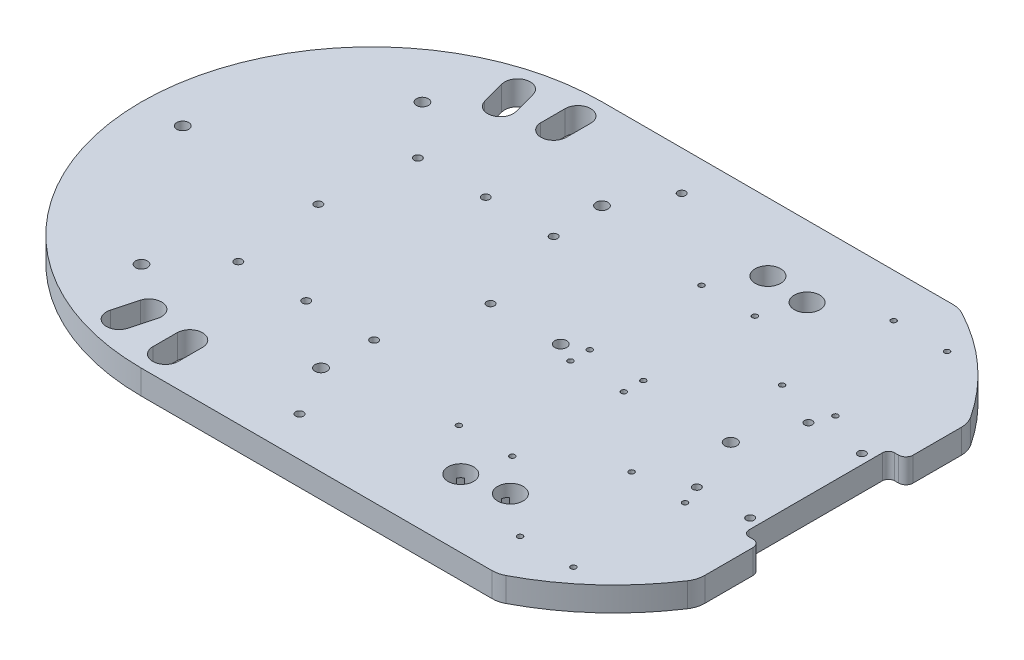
from build123d import *

# Parameters (mm, degrees)
ESQUISSE1_R             = 2.45
ESQUISSE1_R_2           = 5.25
ESQUISSE1_R_3           = 1.1
ESQUISSE1_R_4           = 1.6
ESQUISSE1_R_5           = 2.5
EXTRUSION1_DEPTH        = 10
ESQUISSE2_R             = 1.1
ENL_V_MAT_EXTRU_1_DEPTH = 5


with BuildPart() as part:
    # Esquisse1 → Extrusion1 (new body)
    with BuildSketch(Plane(origin=(0, 0, 0), x_dir=(1, 0, 0), z_dir=(0, 1, 0))):
        with BuildLine():
            Line((140.138781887, 52.856178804), (140.138781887, 32.999324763))
            ThreePointArc((140.138781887, 32.999324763), (139.26010223, 30.87800442), (137.138781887, 29.999324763))
            Line((137.138781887, 29.999324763), (135.5, 30))
            ThreePointArc((135.5, 30), (133.732233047, 29.267766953), (133, 27.5))
            Line((133, 27.5), (133, -27.5))
            ThreePointArc((133, -27.5), (133.732035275, -29.267289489), (135.499324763, -29.999324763))
            Line((135.499324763, -29.999324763), (137.138781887, -29.999324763))
            ThreePointArc((137.138781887, -29.999324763), (139.26010223, -30.87800442), (140.138781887, -32.999324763))
            Line((140.138781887, -32.999324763), (140.138781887, -52.856178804))
            ThreePointArc((140.138781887, -52.856178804), (139.716827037, -55.730383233), (138.486571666, -58.362030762))
            ThreePointArc((138.486571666, -58.362030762), (121.126964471, -78.593606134), (99.268604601, -93.854166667))
            ThreePointArc((99.268604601, -93.854166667), (97.014190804, -94.709316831), (94.620623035, -95))
            Line((94.620623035, -95), (-50, -95))
            ThreePointArc((-50, -95), (-145, 0), (-50, 95))
            Line((-50, 95), (94.620623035, 95))
            ThreePointArc((94.620623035, 95), (97.014190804, 94.709316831), (99.268604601, 93.854166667))
            ThreePointArc((99.268604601, 93.854166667), (121.126964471, 78.593606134), (138.486571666, 58.362030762))
            ThreePointArc((138.486571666, 58.362030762), (139.716827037, 55.730383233), (140.138781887, 52.856178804))
        make_face()
        with Locations(Location((-87, -57.9, 0), (0, 0, 270))):
            Circle(ESQUISSE1_R, mode=Mode.SUBTRACT)
        with Locations(Location((70.914801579, -63.759399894, 0), (0, 0, 270))):
            Circle(ESQUISSE1_R_2, mode=Mode.SUBTRACT)
        with Locations(Location((110.138781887, -31, 0), (0, 0, 270))):
            Circle(ESQUISSE1_R_3, mode=Mode.SUBTRACT)
        with Locations(Location((88.138781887, 31, 0), (0, 0, 90))):
            Circle(ESQUISSE1_R_3, mode=Mode.SUBTRACT)
        with Locations(Location((-12, 37, 0), (0, 0, 270))):
            Circle(ESQUISSE1_R_4, mode=Mode.SUBTRACT)
        with Locations(Location((110.138781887, 31, 0), (0, 0, 90))):
            Circle(ESQUISSE1_R_3, mode=Mode.SUBTRACT)
        with Locations(Location((53.7, -67, 0), (0, 0, 270))):
            Circle(ESQUISSE1_R_2, mode=Mode.SUBTRACT)
        with Locations(Location((88.138781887, -31, 0), (0, 0, 270))):
            Circle(ESQUISSE1_R_3, mode=Mode.SUBTRACT)
        with Locations(Location((-40, 37, 0), (0, 0, 90))):
            Circle(ESQUISSE1_R_4, mode=Mode.SUBTRACT)
        with Locations(Location((-12, -37, 0), (0, 0, 90))):
            Circle(ESQUISSE1_R_4, mode=Mode.SUBTRACT)
        with Locations(Location((-40, -37, 0), (0, 0, 270))):
            Circle(ESQUISSE1_R_4, mode=Mode.SUBTRACT)
        with Locations(Location((-1, 78.75, 0), (0, 0, 270))):
            Circle(ESQUISSE1_R_4, mode=Mode.SUBTRACT)
        with Locations(Location((-1, -78.75, 0), (0, 0, 90))):
            Circle(ESQUISSE1_R_4, mode=Mode.SUBTRACT)
        with Locations(Location((-1, 0, 0), (0, 0, 270))):
            Circle(ESQUISSE1_R_4, mode=Mode.SUBTRACT)
        with Locations(Location((88.138781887, -77, 0), (0, 0, 90))):
            Circle(ESQUISSE1_R_3, mode=Mode.SUBTRACT)
        with Locations(Location((110.138781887, -77, 0), (0, 0, 90))):
            Circle(ESQUISSE1_R_3, mode=Mode.SUBTRACT)
        with Locations(Location((129, 23, 0), (0, 0, 270))):
            Circle(ESQUISSE1_R_4, mode=Mode.SUBTRACT)
        with Locations(Location((107, 23, 0), (0, 0, 270))):
            Circle(ESQUISSE1_R_4, mode=Mode.SUBTRACT)
        with Locations(Location((107, -23, 0), (0, 0, 90))):
            Circle(ESQUISSE1_R_4, mode=Mode.SUBTRACT)
        with Locations(Location((129, -23, 0), (0, 0, 90))):
            Circle(ESQUISSE1_R_4, mode=Mode.SUBTRACT)
        with Locations(Location((-127.9, 0, 0), (0, 0, 270))):
            Circle(ESQUISSE1_R, mode=Mode.SUBTRACT)
        with Locations(Location((110.138781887, 77, 0), (0, 0, 270))):
            Circle(ESQUISSE1_R_3, mode=Mode.SUBTRACT)
        with Locations(Location((63.766950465, 65.674660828, 0), (0, 0, 270))):
            Circle(ESQUISSE1_R_2, mode=Mode.SUBTRACT)
        with Locations(Location((46.3, 67, 0), (0, 0, 270))):
            Circle(ESQUISSE1_R_2, mode=Mode.SUBTRACT)
        with Locations(Location((27.9, 0, 0), (0, 0, 90))):
            Circle(ESQUISSE1_R, mode=Mode.SUBTRACT)
        with Locations(Location((-13, -57.9, 0), (0, 0, 90))):
            Circle(ESQUISSE1_R, mode=Mode.SUBTRACT)
        with Locations(Location((-13, 57.9, 0), (0, 0, 270))):
            Circle(ESQUISSE1_R, mode=Mode.SUBTRACT)
        with Locations(Location((-87, 57.9, 0), (0, 0, 90))):
            Circle(ESQUISSE1_R, mode=Mode.SUBTRACT)
        with Locations(Location((98, 0, 0), (0, 0, 270))):
            Circle(ESQUISSE1_R_5, mode=Mode.SUBTRACT)
        with Locations(Location((88.138781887, 77, 0), (0, 0, 270))):
            Circle(ESQUISSE1_R_3, mode=Mode.SUBTRACT)
        with Locations(Location((-68, -37, 0), (0, 0, 270))):
            Circle(ESQUISSE1_R_4, mode=Mode.SUBTRACT)
        with Locations(Location((-68, 37, 0), (0, 0, 90))):
            Circle(ESQUISSE1_R_4, mode=Mode.SUBTRACT)
        with Locations(Location((57.920081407, 50, 0), (0, 0, 270))):
            Circle(ESQUISSE1_R_3, mode=Mode.SUBTRACT)
        with Locations(Location((35.920081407, 50, 0), (0, 0, 270))):
            Circle(ESQUISSE1_R_3, mode=Mode.SUBTRACT)
        with Locations(Location((35.920081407, 4, 0), (0, 0, 90))):
            Circle(ESQUISSE1_R_3, mode=Mode.SUBTRACT)
        with Locations(Location((57.920081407, 4, 0), (0, 0, 90))):
            Circle(ESQUISSE1_R_3, mode=Mode.SUBTRACT)
        with Locations(Location((-72, 0, 0), (0, 0, 270))):
            Circle(ESQUISSE1_R_4, mode=Mode.SUBTRACT)
        with Locations(Location((35.920081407, -4, 0), (0, 0, 270))):
            Circle(ESQUISSE1_R_3, mode=Mode.SUBTRACT)
        with Locations(Location((57.920081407, -4, 0), (0, 0, 270))):
            Circle(ESQUISSE1_R_3, mode=Mode.SUBTRACT)
        with Locations(Location((57.920081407, -50, 0), (0, 0, 90))):
            Circle(ESQUISSE1_R_3, mode=Mode.SUBTRACT)
        with Locations(Location((35.920081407, -50, 0), (0, 0, 90))):
            Circle(ESQUISSE1_R_3, mode=Mode.SUBTRACT)
        with BuildLine():
            Line((-55.247495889, -84.837867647), (-55.24678339, -74.81625))
            ThreePointArc((-55.24678339, -74.81625), (-50, -69.75), (-44.75321661, -74.81625))
            Line((-44.75321661, -74.81625), (-44.752504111, -84.837867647))
            ThreePointArc((-44.752504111, -84.837867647), (-50, -90.25), (-55.247495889, -84.837867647))
        make_face(mode=Mode.SUBTRACT)
        with BuildLine():
            Line((-77.026347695, -80.588935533), (-74.431873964, -70.908980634))
            ThreePointArc((-74.431873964, -70.908980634), (-68.052628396, -67.373326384), (-64.295866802, -73.624915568))
            Line((-64.295866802, -73.624915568), (-66.888964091, -83.305239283))
            ThreePointArc((-66.888964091, -83.305239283), (-73.358418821, -87.174805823), (-77.026347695, -80.588935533))
        make_face(mode=Mode.SUBTRACT)
        with BuildLine():
            Line((-64.295866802, 73.624915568), (-66.888964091, 83.305239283))
            ThreePointArc((-66.888964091, 83.305239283), (-73.358418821, 87.174805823), (-77.026347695, 80.588935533))
            Line((-77.026347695, 80.588935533), (-74.431873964, 70.908980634))
            ThreePointArc((-74.431873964, 70.908980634), (-68.052628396, 67.373326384), (-64.295866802, 73.624915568))
        make_face(mode=Mode.SUBTRACT)
        with BuildLine():
            Line((-44.75321661, 74.81625), (-44.752504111, 84.837867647))
            ThreePointArc((-44.752504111, 84.837867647), (-50, 90.25), (-55.247495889, 84.837867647))
            Line((-55.247495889, 84.837867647), (-55.24678339, 74.81625))
            ThreePointArc((-55.24678339, 74.81625), (-50, 69.75), (-44.75321661, 74.81625))
        make_face(mode=Mode.SUBTRACT)
    extrude(amount=EXTRUSION1_DEPTH)

    # Esquisse2 → Enl_v. mat.-Extru.1 (cut)
    with BuildSketch(Plane.XZ):
        with Locations(Location((-14, 48, 0), (0, 0, 270))):
            Circle(ESQUISSE2_R)
        with Locations(Location((-14, 72, 0), (0, 0, 90))):
            Circle(ESQUISSE2_R)
        with Locations(Location((-131, -26, 0), (0, 0, 270))):
            Circle(ESQUISSE2_R)
        with Locations(Location((-89, -26, 0), (0, 0, 270))):
            Circle(ESQUISSE2_R)
        with Locations(Location((-38, 48, 0), (0, 0, 90))):
            Circle(ESQUISSE2_R)
        with Locations(Location((-38, 72, 0), (0, 0, 270))):
            Circle(ESQUISSE2_R)
        with Locations(Location((-38, -72, 0), (0, 0, 90))):
            Circle(ESQUISSE2_R)
        with Locations(Location((-38, -48, 0), (0, 0, 270))):
            Circle(ESQUISSE2_R)
        with Locations(Location((-14, -72, 0), (0, 0, 270))):
            Circle(ESQUISSE2_R)
        with Locations(Location((-14, -48, 0), (0, 0, 90))):
            Circle(ESQUISSE2_R)
        with Locations(Location((-131, 26, 0), (0, 0, 90))):
            Circle(ESQUISSE2_R)
        with Locations(Location((-89, 26, 0), (0, 0, 90))):
            Circle(ESQUISSE2_R)
        with BuildLine():
            Line((-3.7372583, -62.25), (1.7372583, -62.25))
            ThreePointArc((1.7372583, -62.25), (4, -62.25), (4, -59.9872583))
            Line((4, -59.9872583), (4, -14.5127417))
            ThreePointArc((4, -14.5127417), (4, -12.25), (1.7372583, -12.25))
            Line((1.7372583, -12.25), (-3.7372583, -12.25))
            ThreePointArc((-3.7372583, -12.25), (-6, -12.25), (-6, -14.5127417))
            Line((-6, -14.5127417), (-6, -59.9872583))
            ThreePointArc((-6, -59.9872583), (-6, -62.25), (-3.7372583, -62.25))
        make_face()
        with BuildLine():
            Line((4, 14.5127417), (4, 59.9872583))
            ThreePointArc((4, 59.9872583), (4, 62.25), (1.7372583, 62.25))
            Line((1.7372583, 62.25), (-3.7372583, 62.25))
            ThreePointArc((-3.7372583, 62.25), (-6, 62.25), (-6, 59.9872583))
            Line((-6, 59.9872583), (-6, 14.5127417))
            ThreePointArc((-6, 14.5127417), (-6, 12.25), (-3.7372583, 12.25))
            Line((-3.7372583, 12.25), (1.7372583, 12.25))
            ThreePointArc((1.7372583, 12.25), (4, 12.25), (4, 14.5127417))
        make_face()
        with BuildLine():
            Line((-34, 36.2627417), (-34, 37.7372583))
            ThreePointArc((-34, 37.7372583), (-34, 40), (-31.7372583, 40))
            Line((-31.7372583, 40), (-20.2627417, 40))
            ThreePointArc((-20.2627417, 40), (-18, 40), (-18, 37.7372583))
            Line((-18, 37.7372583), (-18, 36.2627417))
            ThreePointArc((-18, 36.2627417), (-18, 34), (-20.2627417, 34))
            Line((-20.2627417, 34), (-31.7372583, 34))
            ThreePointArc((-31.7372583, 34), (-34, 34), (-34, 36.2627417))
        make_face()
        with BuildLine():
            Line((-31.7372583, -40), (-20.2627417, -40))
            ThreePointArc((-20.2627417, -40), (-18, -40), (-18, -37.7372583))
            Line((-18, -37.7372583), (-18, -36.2627417))
            ThreePointArc((-18, -36.2627417), (-18, -34), (-20.2627417, -34))
            Line((-20.2627417, -34), (-31.7372583, -34))
            ThreePointArc((-31.7372583, -34), (-34, -34), (-34, -36.2627417))
            Line((-34, -36.2627417), (-34, -37.7372583))
            ThreePointArc((-34, -37.7372583), (-34, -40), (-31.7372583, -40))
        make_face()
        with BuildLine():
            Line((49.2, 93.2), (49.2, 40.8))
            ThreePointArc((49.2, 40.8), (50, 40), (50.8, 40.8))
            Line((50.8, 40.8), (50.8, 93.2))
            ThreePointArc((50.8, 93.2), (50, 94), (49.2, 93.2))
        make_face()
        with BuildLine():
            Line((61.332557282, 39.202718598), (74.894674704, 89.81723204))
            ThreePointArc((74.894674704, 89.81723204), (74.328989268, 90.797027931), (73.349193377, 90.231342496))
            Line((73.349193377, 90.231342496), (59.787075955, 39.616829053))
            ThreePointArc((59.787075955, 39.616829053), (60.352761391, 38.637033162), (61.332557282, 39.202718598))
        make_face()
        with BuildLine():
            Line((-59.7372583, 34), (-48.2627417, 34))
            ThreePointArc((-48.2627417, 34), (-46, 34), (-46, 36.2627417))
            Line((-46, 36.2627417), (-46, 37.7372583))
            ThreePointArc((-46, 37.7372583), (-46, 40), (-48.2627417, 40))
            Line((-48.2627417, 40), (-59.7372583, 40))
            ThreePointArc((-59.7372583, 40), (-62, 40), (-62, 37.7372583))
            Line((-62, 37.7372583), (-62, 36.2627417))
            ThreePointArc((-62, 36.2627417), (-62, 34), (-59.7372583, 34))
        make_face()
        with BuildLine():
            Line((-46, -36.2627417), (-46, -37.7372583))
            ThreePointArc((-46, -37.7372583), (-46, -40), (-48.2627417, -40))
            Line((-48.2627417, -40), (-59.7372583, -40))
            ThreePointArc((-59.7372583, -40), (-62, -40), (-62, -37.7372583))
            Line((-62, -37.7372583), (-62, -36.2627417))
            ThreePointArc((-62, -36.2627417), (-62, -34), (-59.7372583, -34))
            Line((-59.7372583, -34), (-48.2627417, -34))
            ThreePointArc((-48.2627417, -34), (-46, -34), (-46, -36.2627417))
        make_face()
        with BuildLine():
            Line((59.787081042, -39.616827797), (73.349204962, -90.231339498))
            ThreePointArc((73.349204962, -90.231339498), (74.329000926, -90.797024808), (74.894686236, -89.817228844))
            Line((74.894686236, -89.817228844), (61.332562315, -39.202717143))
            ThreePointArc((61.332562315, -39.202717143), (60.352766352, -38.637031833), (59.787081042, -39.616827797))
        make_face()
        with BuildLine():
            Line((49.200005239, -40.800000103), (49.200011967, -93.200000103))
            ThreePointArc((49.200011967, -93.200000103), (50.000012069, -94), (50.800011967, -93.199999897))
            Line((50.800011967, -93.199999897), (50.800005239, -40.799999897))
            ThreePointArc((50.800005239, -40.799999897), (50.000005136, -40), (49.200005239, -40.800000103))
        make_face()
    extrude(amount=-ENL_V_MAT_EXTRU_1_DEPTH, mode=Mode.SUBTRACT)


solid = part.part
